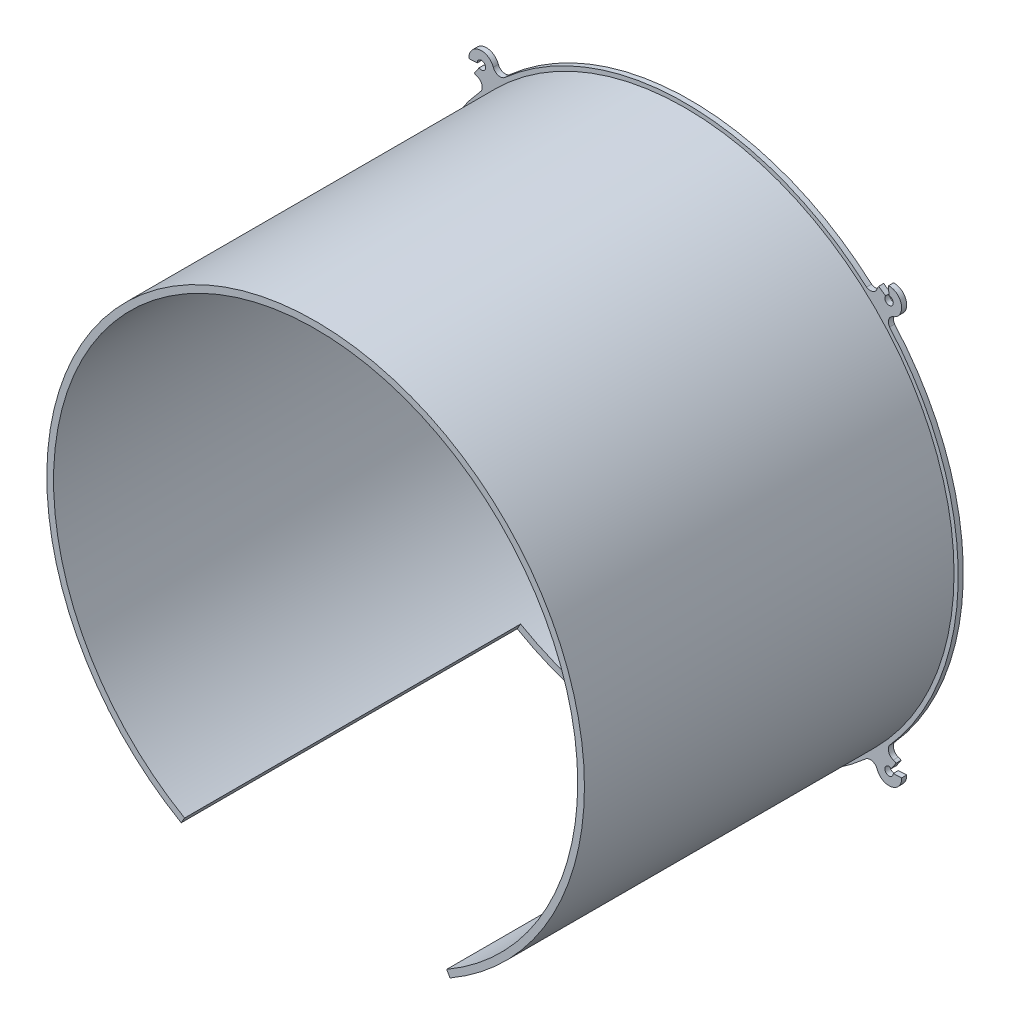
ISO-10303-21;
HEADER;
FILE_DESCRIPTION(('STEP AP214'),'2;1');
FILE_NAME('part.step','',(''),(''),'','','');
FILE_SCHEMA(('AUTOMOTIVE_DESIGN { 1 0 10303 214 1 1 1 1 }'));
ENDSEC;
DATA;
#1=APPLICATION_CONTEXT('core data for automotive mechanical design processes');
#2=APPLICATION_PROTOCOL_DEFINITION('international standard','automotive_design',2000,#1);
#3=PRODUCT_CONTEXT('',#1,'mechanical');
#4=PRODUCT('Part','Part','',(#3));
#5=PRODUCT_RELATED_PRODUCT_CATEGORY('part','',(#4));
#6=PRODUCT_DEFINITION_FORMATION('','',#4);
#7=PRODUCT_DEFINITION_CONTEXT('part definition',#1,'design');
#8=PRODUCT_DEFINITION('design','',#6,#7);
#9=PRODUCT_DEFINITION_SHAPE('','',#8);
#10=(LENGTH_UNIT() NAMED_UNIT(*) SI_UNIT(.MILLI.,.METRE.));
#11=(NAMED_UNIT(*) PLANE_ANGLE_UNIT() SI_UNIT($,.RADIAN.));
#12=(NAMED_UNIT(*) SI_UNIT($,.STERADIAN.) SOLID_ANGLE_UNIT());
#13=UNCERTAINTY_MEASURE_WITH_UNIT(LENGTH_MEASURE(1.E-05),#10,'distance_accuracy_value','');
#14=(GEOMETRIC_REPRESENTATION_CONTEXT(3) GLOBAL_UNCERTAINTY_ASSIGNED_CONTEXT((#13)) GLOBAL_UNIT_ASSIGNED_CONTEXT((#10,
#11,#12)) REPRESENTATION_CONTEXT('',''));
#15=CARTESIAN_POINT('',(0.,0.,0.));
#16=DIRECTION('',(0.,0.,1.));
#17=DIRECTION('',(1.,0.,0.));
#18=AXIS2_PLACEMENT_3D('',#15,#16,#17);
#19=CARTESIAN_POINT('',(121.316615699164,121.316615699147,3.));
#20=DIRECTION('',(0.,0.,1.));
#21=DIRECTION('',(1.,0.,0.));
#22=AXIS2_PLACEMENT_3D('',#19,#20,#21);
#23=PLANE('',#22);
#24=CARTESIAN_POINT('',(0.,0.,3.));
#25=DIRECTION('',(0.,0.,1.));
#26=DIRECTION('',(1.,0.,0.));
#27=AXIS2_PLACEMENT_3D('',#24,#25,#26);
#28=CIRCLE('',#27,160.);
#29=CARTESIAN_POINT('',(160.,0.,3.));
#30=VERTEX_POINT('',#29);
#31=EDGE_CURVE('E435',#30,#30,#28,.T.);
#32=ORIENTED_EDGE('',*,*,#31,.F.);
#33=EDGE_LOOP('',(#32));
#34=FACE_BOUND('',#33,.T.);
#35=CARTESIAN_POINT('',(121.316615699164,121.316615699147,3.));
#36=DIRECTION('',(0.,0.,1.));
#37=DIRECTION('',(1.,0.,0.));
#38=AXIS2_PLACEMENT_3D('',#35,#36,#37);
#39=CIRCLE('',#38,7.50000000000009);
#40=CARTESIAN_POINT('',(123.815697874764,114.245223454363,3.));
#41=VERTEX_POINT('',#40);
#42=CARTESIAN_POINT('',(121.00503651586,128.81014079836,3.));
#43=VERTEX_POINT('',#42);
#44=EDGE_CURVE('E349',#41,#43,#39,.T.);
#45=ORIENTED_EDGE('',*,*,#44,.T.);
#46=DIRECTION('',(0.0415438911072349,-0.999136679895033,0.));
#47=VECTOR('',#46,1.);
#48=CARTESIAN_POINT('',(121.212755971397,123.814457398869,3.));
#49=LINE('',#48,#47);
#50=CARTESIAN_POINT('',(121.212755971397,123.814457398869,3.));
#51=VERTEX_POINT('',#50);
#52=EDGE_CURVE('E171',#43,#51,#49,.T.);
#53=ORIENTED_EDGE('',*,*,#52,.T.);
#54=CARTESIAN_POINT('',(121.316615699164,121.316615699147,3.));
#55=DIRECTION('',(0.,0.,-1.));
#56=DIRECTION('',(1.,0.,0.));
#57=AXIS2_PLACEMENT_3D('',#54,#55,#56);
#58=CIRCLE('',#57,2.49999999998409);
#59=CARTESIAN_POINT('',(119.245818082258,122.717257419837,3.));
#60=VERTEX_POINT('',#59);
#61=EDGE_CURVE('E448',#51,#60,#58,.T.);
#62=ORIENTED_EDGE('',*,*,#61,.T.);
#63=DIRECTION('',(-0.828319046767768,0.560256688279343,0.));
#64=VECTOR('',#63,1.);
#65=CARTESIAN_POINT('',(119.245818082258,122.717257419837,3.));
#66=LINE('',#65,#64);
#67=CARTESIAN_POINT('',(115.104222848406,125.518540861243,3.));
#68=VERTEX_POINT('',#67);
#69=EDGE_CURVE('E450',#60,#68,#66,.T.);
#70=ORIENTED_EDGE('',*,*,#69,.T.);
#71=CARTESIAN_POINT('',(121.316615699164,121.316615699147,3.));
#72=DIRECTION('',(0.,0.,1.));
#73=DIRECTION('',(1.,0.,0.));
#74=AXIS2_PLACEMENT_3D('',#71,#72,#73);
#75=CIRCLE('',#74,7.50000000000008);
#76=CARTESIAN_POINT('',(114.245223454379,123.815697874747,3.));
#77=VERTEX_POINT('',#76);
#78=EDGE_CURVE('E452',#68,#77,#75,.T.);
#79=ORIENTED_EDGE('',*,*,#78,.T.);
#80=CARTESIAN_POINT('',(110.151172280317,125.189414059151,3.));
#81=DIRECTION('',(0.,0.,-1.));
#82=DIRECTION('',(1.,0.,0.));
#83=AXIS2_PLACEMENT_3D('',#80,#81,#82);
#84=CIRCLE('',#83,4.31837367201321);
#85=CARTESIAN_POINT('',(107.90829443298,121.499176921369,3.));
#86=VERTEX_POINT('',#85);
#87=EDGE_CURVE('E454',#77,#86,#84,.T.);
#88=ORIENTED_EDGE('',*,*,#87,.T.);
#89=CARTESIAN_POINT('',(1.6625054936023E-12,-1.5112739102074E-12,3.));
#90=DIRECTION('',(0.,0.,1.));
#91=DIRECTION('',(1.,0.,0.));
#92=AXIS2_PLACEMENT_3D('',#89,#90,#91);
#93=CIRCLE('',#92,162.500000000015);
#94=CARTESIAN_POINT('',(-107.756168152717,121.634116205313,3.));
#95=VERTEX_POINT('',#94);
#96=EDGE_CURVE('E456',#86,#95,#93,.T.);
#97=ORIENTED_EDGE('',*,*,#96,.T.);
#98=CARTESIAN_POINT('',(-110.147061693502,125.264018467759,3.));
#99=DIRECTION('',(0.,0.,-1.));
#100=DIRECTION('',(1.,0.,0.));
#101=AXIS2_PLACEMENT_3D('',#98,#99,#100);
#102=CIRCLE('',#101,4.34655752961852);
#103=CARTESIAN_POINT('',(-114.245223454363,123.815697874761,3.));
#104=VERTEX_POINT('',#103);
#105=EDGE_CURVE('E458',#95,#104,#102,.T.);
#106=ORIENTED_EDGE('',*,*,#105,.T.);
#107=CARTESIAN_POINT('',(-121.316615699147,121.316615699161,3.));
#108=DIRECTION('',(0.,0.,1.));
#109=DIRECTION('',(1.,0.,0.));
#110=AXIS2_PLACEMENT_3D('',#107,#108,#109);
#111=CIRCLE('',#110,7.5000000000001);
#112=CARTESIAN_POINT('',(-128.81014079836,121.005036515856,3.));
#113=VERTEX_POINT('',#112);
#114=EDGE_CURVE('E460',#104,#113,#111,.T.);
#115=ORIENTED_EDGE('',*,*,#114,.T.);
#116=DIRECTION('',(0.999136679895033,0.0415438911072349,0.));
#117=VECTOR('',#116,1.);
#118=CARTESIAN_POINT('',(-123.814457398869,121.212755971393,3.));
#119=LINE('',#118,#117);
#120=CARTESIAN_POINT('',(-123.814457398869,121.212755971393,3.));
#121=VERTEX_POINT('',#120);
#122=EDGE_CURVE('E462',#113,#121,#119,.T.);
#123=ORIENTED_EDGE('',*,*,#122,.T.);
#124=CARTESIAN_POINT('',(-121.316615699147,121.316615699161,3.));
#125=DIRECTION('',(0.,0.,-1.));
#126=DIRECTION('',(1.,0.,0.));
#127=AXIS2_PLACEMENT_3D('',#124,#125,#126);
#128=CIRCLE('',#127,2.49999999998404);
#129=CARTESIAN_POINT('',(-122.717257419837,119.245818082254,3.));
#130=VERTEX_POINT('',#129);
#131=EDGE_CURVE('E464',#121,#130,#128,.T.);
#132=ORIENTED_EDGE('',*,*,#131,.T.);
#133=DIRECTION('',(-0.560256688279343,-0.828319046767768,0.));
#134=VECTOR('',#133,1.);
#135=CARTESIAN_POINT('',(-122.717257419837,119.245818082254,3.));
#136=LINE('',#135,#134);
#137=CARTESIAN_POINT('',(-125.518540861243,115.104222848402,3.));
#138=VERTEX_POINT('',#137);
#139=EDGE_CURVE('E466',#130,#138,#136,.T.);
#140=ORIENTED_EDGE('',*,*,#139,.T.);
#141=CARTESIAN_POINT('',(-121.316615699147,121.316615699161,3.));
#142=DIRECTION('',(0.,0.,1.));
#143=DIRECTION('',(1.,0.,0.));
#144=AXIS2_PLACEMENT_3D('',#141,#142,#143);
#145=CIRCLE('',#144,7.50000000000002);
#146=CARTESIAN_POINT('',(-123.815697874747,114.245223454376,3.));
#147=VERTEX_POINT('',#146);
#148=EDGE_CURVE('E468',#138,#147,#145,.T.);
#149=ORIENTED_EDGE('',*,*,#148,.T.);
#150=CARTESIAN_POINT('',(-125.189414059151,110.151172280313,3.));
#151=DIRECTION('',(0.,0.,-1.));
#152=DIRECTION('',(1.,0.,0.));
#153=AXIS2_PLACEMENT_3D('',#150,#151,#152);
#154=CIRCLE('',#153,4.31837367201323);
#155=CARTESIAN_POINT('',(-121.499176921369,107.908294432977,3.));
#156=VERTEX_POINT('',#155);
#157=EDGE_CURVE('E470',#147,#156,#154,.T.);
#158=ORIENTED_EDGE('',*,*,#157,.T.);
#159=CARTESIAN_POINT('',(1.6625054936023E-12,-1.5112739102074E-12,3.));
#160=DIRECTION('',(0.,0.,1.));
#161=DIRECTION('',(1.,0.,0.));
#162=AXIS2_PLACEMENT_3D('',#159,#160,#161);
#163=CIRCLE('',#162,162.500000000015);
#164=CARTESIAN_POINT('',(-121.634116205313,-107.75616815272,3.));
#165=VERTEX_POINT('',#164);
#166=EDGE_CURVE('E472',#156,#165,#163,.T.);
#167=ORIENTED_EDGE('',*,*,#166,.T.);
#168=CARTESIAN_POINT('',(-125.264018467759,-110.147061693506,3.));
#169=DIRECTION('',(0.,0.,-1.));
#170=DIRECTION('',(1.,0.,0.));
#171=AXIS2_PLACEMENT_3D('',#168,#169,#170);
#172=CIRCLE('',#171,4.34655752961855);
#173=CARTESIAN_POINT('',(-123.815697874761,-114.245223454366,3.));
#174=VERTEX_POINT('',#173);
#175=EDGE_CURVE('E474',#165,#174,#172,.T.);
#176=ORIENTED_EDGE('',*,*,#175,.T.);
#177=CARTESIAN_POINT('',(-121.316615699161,-121.316615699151,3.));
#178=DIRECTION('',(0.,0.,1.));
#179=DIRECTION('',(1.,0.,0.));
#180=AXIS2_PLACEMENT_3D('',#177,#178,#179);
#181=CIRCLE('',#180,7.50000000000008);
#182=CARTESIAN_POINT('',(-121.005036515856,-128.810140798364,3.));
#183=VERTEX_POINT('',#182);
#184=EDGE_CURVE('E476',#174,#183,#181,.T.);
#185=ORIENTED_EDGE('',*,*,#184,.T.);
#186=DIRECTION('',(-0.0415438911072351,0.999136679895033,0.));
#187=VECTOR('',#186,1.);
#188=CARTESIAN_POINT('',(-121.212755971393,-123.814457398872,3.));
#189=LINE('',#188,#187);
#190=CARTESIAN_POINT('',(-121.212755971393,-123.814457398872,3.));
#191=VERTEX_POINT('',#190);
#192=EDGE_CURVE('E478',#183,#191,#189,.T.);
#193=ORIENTED_EDGE('',*,*,#192,.T.);
#194=CARTESIAN_POINT('',(-121.316615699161,-121.316615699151,3.));
#195=DIRECTION('',(0.,0.,-1.));
#196=DIRECTION('',(1.,0.,0.));
#197=AXIS2_PLACEMENT_3D('',#194,#195,#196);
#198=CIRCLE('',#197,2.49999999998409);
#199=CARTESIAN_POINT('',(-119.245818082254,-122.71725741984,3.));
#200=VERTEX_POINT('',#199);
#201=EDGE_CURVE('E480',#191,#200,#198,.T.);
#202=ORIENTED_EDGE('',*,*,#201,.T.);
#203=DIRECTION('',(0.828319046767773,-0.560256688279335,0.));
#204=VECTOR('',#203,1.);
#205=CARTESIAN_POINT('',(-119.245818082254,-122.71725741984,3.));
#206=LINE('',#205,#204);
#207=CARTESIAN_POINT('',(-115.104222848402,-125.518540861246,3.));
#208=VERTEX_POINT('',#207);
#209=EDGE_CURVE('E482',#200,#208,#206,.T.);
#210=ORIENTED_EDGE('',*,*,#209,.T.);
#211=CARTESIAN_POINT('',(-121.316615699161,-121.316615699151,3.));
#212=DIRECTION('',(0.,0.,1.));
#213=DIRECTION('',(1.,0.,0.));
#214=AXIS2_PLACEMENT_3D('',#211,#212,#213);
#215=CIRCLE('',#214,7.50000000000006);
#216=CARTESIAN_POINT('',(-114.245223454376,-123.815697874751,3.));
#217=VERTEX_POINT('',#216);
#218=EDGE_CURVE('E484',#208,#217,#215,.T.);
#219=ORIENTED_EDGE('',*,*,#218,.T.);
#220=CARTESIAN_POINT('',(-110.151172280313,-125.189414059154,3.));
#221=DIRECTION('',(0.,0.,-1.));
#222=DIRECTION('',(1.,0.,0.));
#223=AXIS2_PLACEMENT_3D('',#220,#221,#222);
#224=CIRCLE('',#223,4.31837367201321);
#225=CARTESIAN_POINT('',(-107.908294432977,-121.499176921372,3.));
#226=VERTEX_POINT('',#225);
#227=EDGE_CURVE('E486',#217,#226,#224,.T.);
#228=ORIENTED_EDGE('',*,*,#227,.T.);
#229=CARTESIAN_POINT('',(1.6625054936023E-12,-1.5112739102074E-12,3.));
#230=DIRECTION('',(0.,0.,1.));
#231=DIRECTION('',(1.,0.,0.));
#232=AXIS2_PLACEMENT_3D('',#229,#230,#231);
#233=CIRCLE('',#232,162.500000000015);
#234=CARTESIAN_POINT('',(107.75616815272,-121.634116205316,3.));
#235=VERTEX_POINT('',#234);
#236=EDGE_CURVE('E488',#226,#235,#233,.T.);
#237=ORIENTED_EDGE('',*,*,#236,.T.);
#238=CARTESIAN_POINT('',(110.147061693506,-125.264018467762,3.));
#239=DIRECTION('',(0.,0.,-1.));
#240=DIRECTION('',(1.,0.,0.));
#241=AXIS2_PLACEMENT_3D('',#238,#239,#240);
#242=CIRCLE('',#241,4.34655752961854);
#243=CARTESIAN_POINT('',(114.245223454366,-123.815697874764,3.));
#244=VERTEX_POINT('',#243);
#245=EDGE_CURVE('E490',#235,#244,#242,.T.);
#246=ORIENTED_EDGE('',*,*,#245,.T.);
#247=CARTESIAN_POINT('',(121.316615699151,-121.316615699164,3.));
#248=DIRECTION('',(0.,0.,1.));
#249=DIRECTION('',(1.,0.,0.));
#250=AXIS2_PLACEMENT_3D('',#247,#248,#249);
#251=CIRCLE('',#250,7.50000000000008);
#252=CARTESIAN_POINT('',(128.810140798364,-121.00503651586,3.));
#253=VERTEX_POINT('',#252);
#254=EDGE_CURVE('E492',#244,#253,#251,.T.);
#255=ORIENTED_EDGE('',*,*,#254,.T.);
#256=DIRECTION('',(-0.999136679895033,-0.0415438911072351,0.));
#257=VECTOR('',#256,1.);
#258=CARTESIAN_POINT('',(123.814457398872,-121.212755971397,3.));
#259=LINE('',#258,#257);
#260=CARTESIAN_POINT('',(123.814457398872,-121.212755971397,3.));
#261=VERTEX_POINT('',#260);
#262=EDGE_CURVE('E494',#253,#261,#259,.T.);
#263=ORIENTED_EDGE('',*,*,#262,.T.);
#264=CARTESIAN_POINT('',(121.316615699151,-121.316615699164,3.));
#265=DIRECTION('',(0.,0.,-1.));
#266=DIRECTION('',(1.,0.,0.));
#267=AXIS2_PLACEMENT_3D('',#264,#265,#266);
#268=CIRCLE('',#267,2.49999999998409);
#269=CARTESIAN_POINT('',(122.71725741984,-119.245818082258,3.));
#270=VERTEX_POINT('',#269);
#271=EDGE_CURVE('E496',#261,#270,#268,.T.);
#272=ORIENTED_EDGE('',*,*,#271,.T.);
#273=DIRECTION('',(0.560256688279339,0.82831904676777,0.));
#274=VECTOR('',#273,1.);
#275=CARTESIAN_POINT('',(122.71725741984,-119.245818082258,3.));
#276=LINE('',#275,#274);
#277=CARTESIAN_POINT('',(125.518540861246,-115.104222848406,3.));
#278=VERTEX_POINT('',#277);
#279=EDGE_CURVE('E498',#270,#278,#276,.T.);
#280=ORIENTED_EDGE('',*,*,#279,.T.);
#281=CARTESIAN_POINT('',(121.316615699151,-121.316615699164,3.));
#282=DIRECTION('',(0.,0.,1.));
#283=DIRECTION('',(1.,0.,0.));
#284=AXIS2_PLACEMENT_3D('',#281,#282,#283);
#285=CIRCLE('',#284,7.50000000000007);
#286=CARTESIAN_POINT('',(123.815697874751,-114.245223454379,3.));
#287=VERTEX_POINT('',#286);
#288=EDGE_CURVE('E264',#278,#287,#285,.T.);
#289=ORIENTED_EDGE('',*,*,#288,.T.);
#290=CARTESIAN_POINT('',(125.189414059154,-110.151172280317,3.));
#291=DIRECTION('',(0.,0.,-1.));
#292=DIRECTION('',(1.,0.,0.));
#293=AXIS2_PLACEMENT_3D('',#290,#291,#292);
#294=CIRCLE('',#293,4.31837367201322);
#295=CARTESIAN_POINT('',(121.499176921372,-107.90829443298,3.));
#296=VERTEX_POINT('',#295);
#297=EDGE_CURVE('E258',#287,#296,#294,.T.);
#298=ORIENTED_EDGE('',*,*,#297,.T.);
#299=CARTESIAN_POINT('',(1.6625054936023E-12,-1.5112739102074E-12,3.));
#300=DIRECTION('',(0.,0.,1.));
#301=DIRECTION('',(1.,0.,0.));
#302=AXIS2_PLACEMENT_3D('',#299,#300,#301);
#303=CIRCLE('',#302,162.500000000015);
#304=CARTESIAN_POINT('',(121.634116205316,107.756168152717,3.));
#305=VERTEX_POINT('',#304);
#306=EDGE_CURVE('E261',#296,#305,#303,.T.);
#307=ORIENTED_EDGE('',*,*,#306,.T.);
#308=CARTESIAN_POINT('',(125.264018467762,110.147061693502,3.));
#309=DIRECTION('',(0.,0.,-1.));
#310=DIRECTION('',(1.,0.,0.));
#311=AXIS2_PLACEMENT_3D('',#308,#309,#310);
#312=CIRCLE('',#311,4.34655752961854);
#313=EDGE_CURVE('E57',#305,#41,#312,.T.);
#314=ORIENTED_EDGE('',*,*,#313,.T.);
#315=EDGE_LOOP('',(#45,#53,#62,#70,#79,#88,#97,#106,#115,#123,#132,#140,#149,#158,#167,#176,
#185,#193,#202,#210,#219,#228,#237,#246,#255,#263,#272,#280,#289,#298,#307,#314));
#316=FACE_BOUND('',#315,.T.);
#317=ADVANCED_FACE('F33',(#34,#316),#23,.T.);
#318=CARTESIAN_POINT('',(121.316615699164,121.316615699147,0.));
#319=DIRECTION('',(0.,0.,1.));
#320=DIRECTION('',(1.,0.,0.));
#321=AXIS2_PLACEMENT_3D('',#318,#319,#320);
#322=PLANE('',#321);
#323=CARTESIAN_POINT('',(121.316615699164,121.316615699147,0.));
#324=DIRECTION('',(0.,0.,1.));
#325=DIRECTION('',(1.,0.,0.));
#326=AXIS2_PLACEMENT_3D('',#323,#324,#325);
#327=CIRCLE('',#326,7.50000000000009);
#328=CARTESIAN_POINT('',(123.815697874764,114.245223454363,0.));
#329=VERTEX_POINT('',#328);
#330=CARTESIAN_POINT('',(121.00503651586,128.81014079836,0.));
#331=VERTEX_POINT('',#330);
#332=EDGE_CURVE('E285',#329,#331,#327,.T.);
#333=ORIENTED_EDGE('',*,*,#332,.F.);
#334=CARTESIAN_POINT('',(125.264018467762,110.147061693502,0.));
#335=DIRECTION('',(0.,0.,-1.));
#336=DIRECTION('',(1.,0.,0.));
#337=AXIS2_PLACEMENT_3D('',#334,#335,#336);
#338=CIRCLE('',#337,4.34655752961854);
#339=CARTESIAN_POINT('',(121.634116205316,107.756168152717,0.));
#340=VERTEX_POINT('',#339);
#341=EDGE_CURVE('E162',#340,#329,#338,.T.);
#342=ORIENTED_EDGE('',*,*,#341,.F.);
#343=CARTESIAN_POINT('',(1.6625054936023E-12,-1.5112739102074E-12,0.));
#344=DIRECTION('',(0.,0.,1.));
#345=DIRECTION('',(1.,0.,0.));
#346=AXIS2_PLACEMENT_3D('',#343,#344,#345);
#347=CIRCLE('',#346,162.500000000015);
#348=CARTESIAN_POINT('',(121.499176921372,-107.90829443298,0.));
#349=VERTEX_POINT('',#348);
#350=EDGE_CURVE('E346',#349,#340,#347,.T.);
#351=ORIENTED_EDGE('',*,*,#350,.F.);
#352=CARTESIAN_POINT('',(125.189414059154,-110.151172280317,0.));
#353=DIRECTION('',(0.,0.,-1.));
#354=DIRECTION('',(1.,0.,0.));
#355=AXIS2_PLACEMENT_3D('',#352,#353,#354);
#356=CIRCLE('',#355,4.31837367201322);
#357=CARTESIAN_POINT('',(123.815697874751,-114.245223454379,0.));
#358=VERTEX_POINT('',#357);
#359=EDGE_CURVE('E273',#358,#349,#356,.T.);
#360=ORIENTED_EDGE('',*,*,#359,.F.);
#361=CARTESIAN_POINT('',(121.316615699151,-121.316615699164,0.));
#362=DIRECTION('',(0.,0.,1.));
#363=DIRECTION('',(1.,0.,0.));
#364=AXIS2_PLACEMENT_3D('',#361,#362,#363);
#365=CIRCLE('',#364,7.50000000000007);
#366=CARTESIAN_POINT('',(125.518540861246,-115.104222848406,0.));
#367=VERTEX_POINT('',#366);
#368=EDGE_CURVE('E343',#367,#358,#365,.T.);
#369=ORIENTED_EDGE('',*,*,#368,.F.);
#370=DIRECTION('',(0.560256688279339,0.82831904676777,0.));
#371=VECTOR('',#370,1.);
#372=CARTESIAN_POINT('',(122.71725741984,-119.245818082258,0.));
#373=LINE('',#372,#371);
#374=CARTESIAN_POINT('',(122.71725741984,-119.245818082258,0.));
#375=VERTEX_POINT('',#374);
#376=EDGE_CURVE('E341',#375,#367,#373,.T.);
#377=ORIENTED_EDGE('',*,*,#376,.F.);
#378=CARTESIAN_POINT('',(121.316615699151,-121.316615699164,0.));
#379=DIRECTION('',(0.,0.,-1.));
#380=DIRECTION('',(1.,0.,0.));
#381=AXIS2_PLACEMENT_3D('',#378,#379,#380);
#382=CIRCLE('',#381,2.49999999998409);
#383=CARTESIAN_POINT('',(123.814457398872,-121.212755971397,0.));
#384=VERTEX_POINT('',#383);
#385=EDGE_CURVE('E339',#384,#375,#382,.T.);
#386=ORIENTED_EDGE('',*,*,#385,.F.);
#387=DIRECTION('',(-0.999136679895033,-0.0415438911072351,0.));
#388=VECTOR('',#387,1.);
#389=CARTESIAN_POINT('',(123.814457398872,-121.212755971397,0.));
#390=LINE('',#389,#388);
#391=CARTESIAN_POINT('',(128.810140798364,-121.00503651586,0.));
#392=VERTEX_POINT('',#391);
#393=EDGE_CURVE('E337',#392,#384,#390,.T.);
#394=ORIENTED_EDGE('',*,*,#393,.F.);
#395=CARTESIAN_POINT('',(121.316615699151,-121.316615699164,0.));
#396=DIRECTION('',(0.,0.,1.));
#397=DIRECTION('',(1.,0.,0.));
#398=AXIS2_PLACEMENT_3D('',#395,#396,#397);
#399=CIRCLE('',#398,7.50000000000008);
#400=CARTESIAN_POINT('',(114.245223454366,-123.815697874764,0.));
#401=VERTEX_POINT('',#400);
#402=EDGE_CURVE('E335',#401,#392,#399,.T.);
#403=ORIENTED_EDGE('',*,*,#402,.F.);
#404=CARTESIAN_POINT('',(110.147061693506,-125.264018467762,0.));
#405=DIRECTION('',(0.,0.,-1.));
#406=DIRECTION('',(1.,0.,0.));
#407=AXIS2_PLACEMENT_3D('',#404,#405,#406);
#408=CIRCLE('',#407,4.34655752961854);
#409=CARTESIAN_POINT('',(107.75616815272,-121.634116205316,0.));
#410=VERTEX_POINT('',#409);
#411=EDGE_CURVE('E333',#410,#401,#408,.T.);
#412=ORIENTED_EDGE('',*,*,#411,.F.);
#413=CARTESIAN_POINT('',(1.6625054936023E-12,-1.5112739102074E-12,0.));
#414=DIRECTION('',(0.,0.,1.));
#415=DIRECTION('',(1.,0.,0.));
#416=AXIS2_PLACEMENT_3D('',#413,#414,#415);
#417=CIRCLE('',#416,162.500000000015);
#418=CARTESIAN_POINT('',(-107.908294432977,-121.499176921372,0.));
#419=VERTEX_POINT('',#418);
#420=EDGE_CURVE('E331',#419,#410,#417,.T.);
#421=ORIENTED_EDGE('',*,*,#420,.F.);
#422=CARTESIAN_POINT('',(-110.151172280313,-125.189414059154,0.));
#423=DIRECTION('',(0.,0.,-1.));
#424=DIRECTION('',(1.,0.,0.));
#425=AXIS2_PLACEMENT_3D('',#422,#423,#424);
#426=CIRCLE('',#425,4.31837367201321);
#427=CARTESIAN_POINT('',(-114.245223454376,-123.815697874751,0.));
#428=VERTEX_POINT('',#427);
#429=EDGE_CURVE('E329',#428,#419,#426,.T.);
#430=ORIENTED_EDGE('',*,*,#429,.F.);
#431=CARTESIAN_POINT('',(-121.316615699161,-121.316615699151,0.));
#432=DIRECTION('',(0.,0.,1.));
#433=DIRECTION('',(1.,0.,0.));
#434=AXIS2_PLACEMENT_3D('',#431,#432,#433);
#435=CIRCLE('',#434,7.50000000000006);
#436=CARTESIAN_POINT('',(-115.104222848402,-125.518540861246,0.));
#437=VERTEX_POINT('',#436);
#438=EDGE_CURVE('E327',#437,#428,#435,.T.);
#439=ORIENTED_EDGE('',*,*,#438,.F.);
#440=DIRECTION('',(0.828319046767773,-0.560256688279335,0.));
#441=VECTOR('',#440,1.);
#442=CARTESIAN_POINT('',(-119.245818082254,-122.71725741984,0.));
#443=LINE('',#442,#441);
#444=CARTESIAN_POINT('',(-119.245818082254,-122.71725741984,0.));
#445=VERTEX_POINT('',#444);
#446=EDGE_CURVE('E325',#445,#437,#443,.T.);
#447=ORIENTED_EDGE('',*,*,#446,.F.);
#448=CARTESIAN_POINT('',(-121.316615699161,-121.316615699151,0.));
#449=DIRECTION('',(0.,0.,-1.));
#450=DIRECTION('',(1.,0.,0.));
#451=AXIS2_PLACEMENT_3D('',#448,#449,#450);
#452=CIRCLE('',#451,2.49999999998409);
#453=CARTESIAN_POINT('',(-121.212755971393,-123.814457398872,0.));
#454=VERTEX_POINT('',#453);
#455=EDGE_CURVE('E323',#454,#445,#452,.T.);
#456=ORIENTED_EDGE('',*,*,#455,.F.);
#457=DIRECTION('',(-0.0415438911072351,0.999136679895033,0.));
#458=VECTOR('',#457,1.);
#459=CARTESIAN_POINT('',(-121.212755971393,-123.814457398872,0.));
#460=LINE('',#459,#458);
#461=CARTESIAN_POINT('',(-121.005036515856,-128.810140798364,0.));
#462=VERTEX_POINT('',#461);
#463=EDGE_CURVE('E321',#462,#454,#460,.T.);
#464=ORIENTED_EDGE('',*,*,#463,.F.);
#465=CARTESIAN_POINT('',(-121.316615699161,-121.316615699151,0.));
#466=DIRECTION('',(0.,0.,1.));
#467=DIRECTION('',(1.,0.,0.));
#468=AXIS2_PLACEMENT_3D('',#465,#466,#467);
#469=CIRCLE('',#468,7.50000000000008);
#470=CARTESIAN_POINT('',(-123.815697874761,-114.245223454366,0.));
#471=VERTEX_POINT('',#470);
#472=EDGE_CURVE('E319',#471,#462,#469,.T.);
#473=ORIENTED_EDGE('',*,*,#472,.F.);
#474=CARTESIAN_POINT('',(-125.264018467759,-110.147061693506,0.));
#475=DIRECTION('',(0.,0.,-1.));
#476=DIRECTION('',(1.,0.,0.));
#477=AXIS2_PLACEMENT_3D('',#474,#475,#476);
#478=CIRCLE('',#477,4.34655752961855);
#479=CARTESIAN_POINT('',(-121.634116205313,-107.75616815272,0.));
#480=VERTEX_POINT('',#479);
#481=EDGE_CURVE('E317',#480,#471,#478,.T.);
#482=ORIENTED_EDGE('',*,*,#481,.F.);
#483=CARTESIAN_POINT('',(1.6625054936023E-12,-1.5112739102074E-12,0.));
#484=DIRECTION('',(0.,0.,1.));
#485=DIRECTION('',(1.,0.,0.));
#486=AXIS2_PLACEMENT_3D('',#483,#484,#485);
#487=CIRCLE('',#486,162.500000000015);
#488=CARTESIAN_POINT('',(-121.499176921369,107.908294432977,0.));
#489=VERTEX_POINT('',#488);
#490=EDGE_CURVE('E315',#489,#480,#487,.T.);
#491=ORIENTED_EDGE('',*,*,#490,.F.);
#492=CARTESIAN_POINT('',(-125.189414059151,110.151172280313,0.));
#493=DIRECTION('',(0.,0.,-1.));
#494=DIRECTION('',(1.,0.,0.));
#495=AXIS2_PLACEMENT_3D('',#492,#493,#494);
#496=CIRCLE('',#495,4.31837367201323);
#497=CARTESIAN_POINT('',(-123.815697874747,114.245223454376,0.));
#498=VERTEX_POINT('',#497);
#499=EDGE_CURVE('E313',#498,#489,#496,.T.);
#500=ORIENTED_EDGE('',*,*,#499,.F.);
#501=CARTESIAN_POINT('',(-121.316615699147,121.316615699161,0.));
#502=DIRECTION('',(0.,0.,1.));
#503=DIRECTION('',(1.,0.,0.));
#504=AXIS2_PLACEMENT_3D('',#501,#502,#503);
#505=CIRCLE('',#504,7.50000000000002);
#506=CARTESIAN_POINT('',(-125.518540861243,115.104222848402,0.));
#507=VERTEX_POINT('',#506);
#508=EDGE_CURVE('E311',#507,#498,#505,.T.);
#509=ORIENTED_EDGE('',*,*,#508,.F.);
#510=DIRECTION('',(-0.560256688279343,-0.828319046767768,0.));
#511=VECTOR('',#510,1.);
#512=CARTESIAN_POINT('',(-122.717257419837,119.245818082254,0.));
#513=LINE('',#512,#511);
#514=CARTESIAN_POINT('',(-122.717257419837,119.245818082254,0.));
#515=VERTEX_POINT('',#514);
#516=EDGE_CURVE('E309',#515,#507,#513,.T.);
#517=ORIENTED_EDGE('',*,*,#516,.F.);
#518=CARTESIAN_POINT('',(-121.316615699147,121.316615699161,0.));
#519=DIRECTION('',(0.,0.,-1.));
#520=DIRECTION('',(1.,0.,0.));
#521=AXIS2_PLACEMENT_3D('',#518,#519,#520);
#522=CIRCLE('',#521,2.49999999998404);
#523=CARTESIAN_POINT('',(-123.814457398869,121.212755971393,0.));
#524=VERTEX_POINT('',#523);
#525=EDGE_CURVE('E307',#524,#515,#522,.T.);
#526=ORIENTED_EDGE('',*,*,#525,.F.);
#527=DIRECTION('',(0.999136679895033,0.0415438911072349,0.));
#528=VECTOR('',#527,1.);
#529=CARTESIAN_POINT('',(-123.814457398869,121.212755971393,0.));
#530=LINE('',#529,#528);
#531=CARTESIAN_POINT('',(-128.81014079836,121.005036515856,0.));
#532=VERTEX_POINT('',#531);
#533=EDGE_CURVE('E305',#532,#524,#530,.T.);
#534=ORIENTED_EDGE('',*,*,#533,.F.);
#535=CARTESIAN_POINT('',(-121.316615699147,121.316615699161,0.));
#536=DIRECTION('',(0.,0.,1.));
#537=DIRECTION('',(1.,0.,0.));
#538=AXIS2_PLACEMENT_3D('',#535,#536,#537);
#539=CIRCLE('',#538,7.5000000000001);
#540=CARTESIAN_POINT('',(-114.245223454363,123.815697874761,0.));
#541=VERTEX_POINT('',#540);
#542=EDGE_CURVE('E303',#541,#532,#539,.T.);
#543=ORIENTED_EDGE('',*,*,#542,.F.);
#544=CARTESIAN_POINT('',(-110.147061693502,125.264018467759,0.));
#545=DIRECTION('',(0.,0.,-1.));
#546=DIRECTION('',(1.,0.,0.));
#547=AXIS2_PLACEMENT_3D('',#544,#545,#546);
#548=CIRCLE('',#547,4.34655752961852);
#549=CARTESIAN_POINT('',(-107.756168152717,121.634116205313,0.));
#550=VERTEX_POINT('',#549);
#551=EDGE_CURVE('E301',#550,#541,#548,.T.);
#552=ORIENTED_EDGE('',*,*,#551,.F.);
#553=CARTESIAN_POINT('',(1.6625054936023E-12,-1.5112739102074E-12,0.));
#554=DIRECTION('',(0.,0.,1.));
#555=DIRECTION('',(1.,0.,0.));
#556=AXIS2_PLACEMENT_3D('',#553,#554,#555);
#557=CIRCLE('',#556,162.500000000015);
#558=CARTESIAN_POINT('',(107.90829443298,121.499176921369,0.));
#559=VERTEX_POINT('',#558);
#560=EDGE_CURVE('E299',#559,#550,#557,.T.);
#561=ORIENTED_EDGE('',*,*,#560,.F.);
#562=CARTESIAN_POINT('',(110.151172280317,125.189414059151,0.));
#563=DIRECTION('',(0.,0.,-1.));
#564=DIRECTION('',(1.,0.,0.));
#565=AXIS2_PLACEMENT_3D('',#562,#563,#564);
#566=CIRCLE('',#565,4.31837367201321);
#567=CARTESIAN_POINT('',(114.245223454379,123.815697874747,0.));
#568=VERTEX_POINT('',#567);
#569=EDGE_CURVE('E297',#568,#559,#566,.T.);
#570=ORIENTED_EDGE('',*,*,#569,.F.);
#571=CARTESIAN_POINT('',(121.316615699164,121.316615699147,0.));
#572=DIRECTION('',(0.,0.,1.));
#573=DIRECTION('',(1.,0.,0.));
#574=AXIS2_PLACEMENT_3D('',#571,#572,#573);
#575=CIRCLE('',#574,7.50000000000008);
#576=CARTESIAN_POINT('',(115.104222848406,125.518540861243,0.));
#577=VERTEX_POINT('',#576);
#578=EDGE_CURVE('E295',#577,#568,#575,.T.);
#579=ORIENTED_EDGE('',*,*,#578,.F.);
#580=DIRECTION('',(-0.828319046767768,0.560256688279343,0.));
#581=VECTOR('',#580,1.);
#582=CARTESIAN_POINT('',(119.245818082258,122.717257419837,0.));
#583=LINE('',#582,#581);
#584=CARTESIAN_POINT('',(119.245818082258,122.717257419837,0.));
#585=VERTEX_POINT('',#584);
#586=EDGE_CURVE('E293',#585,#577,#583,.T.);
#587=ORIENTED_EDGE('',*,*,#586,.F.);
#588=CARTESIAN_POINT('',(121.316615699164,121.316615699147,0.));
#589=DIRECTION('',(0.,0.,-1.));
#590=DIRECTION('',(1.,0.,0.));
#591=AXIS2_PLACEMENT_3D('',#588,#589,#590);
#592=CIRCLE('',#591,2.49999999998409);
#593=CARTESIAN_POINT('',(121.212755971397,123.814457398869,0.));
#594=VERTEX_POINT('',#593);
#595=EDGE_CURVE('E291',#594,#585,#592,.T.);
#596=ORIENTED_EDGE('',*,*,#595,.F.);
#597=DIRECTION('',(0.0415438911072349,-0.999136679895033,0.));
#598=VECTOR('',#597,1.);
#599=CARTESIAN_POINT('',(121.212755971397,123.814457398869,0.));
#600=LINE('',#599,#598);
#601=EDGE_CURVE('E288',#331,#594,#600,.T.);
#602=ORIENTED_EDGE('',*,*,#601,.F.);
#603=EDGE_LOOP('',(#333,#342,#351,#360,#369,#377,#386,#394,#403,#412,#421,#430,#439,#447,#456,
#464,#473,#482,#491,#500,#509,#517,#526,#534,#543,#552,#561,#570,#579,#587,#596,#602));
#604=FACE_BOUND('',#603,.T.);
#605=CARTESIAN_POINT('',(0.,0.,0.));
#606=DIRECTION('',(0.,0.,1.));
#607=DIRECTION('',(1.,0.,0.));
#608=AXIS2_PLACEMENT_3D('',#605,#606,#607);
#609=CIRCLE('',#608,156.);
#610=CARTESIAN_POINT('',(156.,0.,0.));
#611=VERTEX_POINT('',#610);
#612=EDGE_CURVE('E289',#611,#611,#609,.T.);
#613=ORIENTED_EDGE('',*,*,#612,.T.);
#614=EDGE_LOOP('',(#613));
#615=FACE_BOUND('',#614,.T.);
#616=ADVANCED_FACE('F511',(#604,#615),#322,.F.);
#617=CARTESIAN_POINT('',(121.316615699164,121.316615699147,3.));
#618=DIRECTION('',(0.,0.,-1.));
#619=DIRECTION('',(-1.,0.,0.));
#620=AXIS2_PLACEMENT_3D('',#617,#618,#619);
#621=CYLINDRICAL_SURFACE('',#620,7.50000000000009);
#622=ORIENTED_EDGE('',*,*,#332,.T.);
#623=DIRECTION('',(0.,0.,-1.));
#624=VECTOR('',#623,1.);
#625=CARTESIAN_POINT('',(121.00503651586,128.81014079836,3.));
#626=LINE('',#625,#624);
#627=EDGE_CURVE('E434',#43,#331,#626,.T.);
#628=ORIENTED_EDGE('',*,*,#627,.F.);
#629=ORIENTED_EDGE('',*,*,#44,.F.);
#630=DIRECTION('',(0.,0.,-1.));
#631=VECTOR('',#630,1.);
#632=CARTESIAN_POINT('',(123.815697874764,114.245223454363,3.));
#633=LINE('',#632,#631);
#634=EDGE_CURVE('E281',#41,#329,#633,.T.);
#635=ORIENTED_EDGE('',*,*,#634,.T.);
#636=EDGE_LOOP('',(#622,#628,#629,#635));
#637=FACE_BOUND('',#636,.T.);
#638=ADVANCED_FACE('F35',(#637),#621,.T.);
#639=CARTESIAN_POINT('',(121.212755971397,123.814457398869,3.));
#640=DIRECTION('',(0.999136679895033,0.0415438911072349,0.));
#641=DIRECTION('',(-0.0415438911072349,0.999136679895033,0.));
#642=AXIS2_PLACEMENT_3D('',#639,#640,#641);
#643=PLANE('',#642);
#644=ORIENTED_EDGE('',*,*,#601,.T.);
#645=DIRECTION('',(0.,0.,-1.));
#646=VECTOR('',#645,1.);
#647=CARTESIAN_POINT('',(121.212755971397,123.814457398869,3.));
#648=LINE('',#647,#646);
#649=EDGE_CURVE('E431',#51,#594,#648,.T.);
#650=ORIENTED_EDGE('',*,*,#649,.F.);
#651=ORIENTED_EDGE('',*,*,#52,.F.);
#652=ORIENTED_EDGE('',*,*,#627,.T.);
#653=EDGE_LOOP('',(#644,#650,#651,#652));
#654=FACE_BOUND('',#653,.T.);
#655=ADVANCED_FACE('F519',(#654),#643,.F.);
#656=CARTESIAN_POINT('',(121.316615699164,121.316615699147,3.));
#657=DIRECTION('',(0.,0.,-1.));
#658=DIRECTION('',(-1.,0.,0.));
#659=AXIS2_PLACEMENT_3D('',#656,#657,#658);
#660=CYLINDRICAL_SURFACE('',#659,2.49999999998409);
#661=ORIENTED_EDGE('',*,*,#595,.T.);
#662=DIRECTION('',(0.,0.,-1.));
#663=VECTOR('',#662,1.);
#664=CARTESIAN_POINT('',(119.245818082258,122.717257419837,3.));
#665=LINE('',#664,#663);
#666=EDGE_CURVE('E428',#60,#585,#665,.T.);
#667=ORIENTED_EDGE('',*,*,#666,.F.);
#668=ORIENTED_EDGE('',*,*,#61,.F.);
#669=ORIENTED_EDGE('',*,*,#649,.T.);
#670=EDGE_LOOP('',(#661,#667,#668,#669));
#671=FACE_BOUND('',#670,.T.);
#672=ADVANCED_FACE('F522',(#671),#660,.F.);
#673=CARTESIAN_POINT('',(119.245818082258,122.717257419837,3.));
#674=DIRECTION('',(-0.560256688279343,-0.828319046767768,0.));
#675=DIRECTION('',(0.828319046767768,-0.560256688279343,0.));
#676=AXIS2_PLACEMENT_3D('',#673,#674,#675);
#677=PLANE('',#676);
#678=ORIENTED_EDGE('',*,*,#586,.T.);
#679=DIRECTION('',(0.,0.,-1.));
#680=VECTOR('',#679,1.);
#681=CARTESIAN_POINT('',(115.104222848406,125.518540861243,3.));
#682=LINE('',#681,#680);
#683=EDGE_CURVE('E425',#68,#577,#682,.T.);
#684=ORIENTED_EDGE('',*,*,#683,.F.);
#685=ORIENTED_EDGE('',*,*,#69,.F.);
#686=ORIENTED_EDGE('',*,*,#666,.T.);
#687=EDGE_LOOP('',(#678,#684,#685,#686));
#688=FACE_BOUND('',#687,.T.);
#689=ADVANCED_FACE('F527',(#688),#677,.F.);
#690=CARTESIAN_POINT('',(121.316615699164,121.316615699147,3.));
#691=DIRECTION('',(0.,0.,-1.));
#692=DIRECTION('',(-1.,0.,0.));
#693=AXIS2_PLACEMENT_3D('',#690,#691,#692);
#694=CYLINDRICAL_SURFACE('',#693,7.50000000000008);
#695=ORIENTED_EDGE('',*,*,#578,.T.);
#696=DIRECTION('',(0.,0.,-1.));
#697=VECTOR('',#696,1.);
#698=CARTESIAN_POINT('',(114.245223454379,123.815697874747,3.));
#699=LINE('',#698,#697);
#700=EDGE_CURVE('E422',#77,#568,#699,.T.);
#701=ORIENTED_EDGE('',*,*,#700,.F.);
#702=ORIENTED_EDGE('',*,*,#78,.F.);
#703=ORIENTED_EDGE('',*,*,#683,.T.);
#704=EDGE_LOOP('',(#695,#701,#702,#703));
#705=FACE_BOUND('',#704,.T.);
#706=ADVANCED_FACE('F533',(#705),#694,.T.);
#707=CARTESIAN_POINT('',(110.151172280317,125.189414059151,3.));
#708=DIRECTION('',(0.,0.,-1.));
#709=DIRECTION('',(-1.,0.,0.));
#710=AXIS2_PLACEMENT_3D('',#707,#708,#709);
#711=CYLINDRICAL_SURFACE('',#710,4.31837367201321);
#712=ORIENTED_EDGE('',*,*,#569,.T.);
#713=DIRECTION('',(0.,0.,-1.));
#714=VECTOR('',#713,1.);
#715=CARTESIAN_POINT('',(107.90829443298,121.499176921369,3.));
#716=LINE('',#715,#714);
#717=EDGE_CURVE('E419',#86,#559,#716,.T.);
#718=ORIENTED_EDGE('',*,*,#717,.F.);
#719=ORIENTED_EDGE('',*,*,#87,.F.);
#720=ORIENTED_EDGE('',*,*,#700,.T.);
#721=EDGE_LOOP('',(#712,#718,#719,#720));
#722=FACE_BOUND('',#721,.T.);
#723=ADVANCED_FACE('F537',(#722),#711,.F.);
#724=CARTESIAN_POINT('',(1.6625054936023E-12,-1.5112739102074E-12,3.));
#725=DIRECTION('',(0.,0.,-1.));
#726=DIRECTION('',(-1.,0.,0.));
#727=AXIS2_PLACEMENT_3D('',#724,#725,#726);
#728=CYLINDRICAL_SURFACE('',#727,162.500000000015);
#729=ORIENTED_EDGE('',*,*,#560,.T.);
#730=DIRECTION('',(0.,0.,-1.));
#731=VECTOR('',#730,1.);
#732=CARTESIAN_POINT('',(-107.756168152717,121.634116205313,3.));
#733=LINE('',#732,#731);
#734=EDGE_CURVE('E416',#95,#550,#733,.T.);
#735=ORIENTED_EDGE('',*,*,#734,.F.);
#736=ORIENTED_EDGE('',*,*,#96,.F.);
#737=ORIENTED_EDGE('',*,*,#717,.T.);
#738=EDGE_LOOP('',(#729,#735,#736,#737));
#739=FACE_BOUND('',#738,.T.);
#740=ADVANCED_FACE('F542',(#739),#728,.T.);
#741=CARTESIAN_POINT('',(-110.147061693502,125.264018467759,3.));
#742=DIRECTION('',(0.,0.,-1.));
#743=DIRECTION('',(-1.,0.,0.));
#744=AXIS2_PLACEMENT_3D('',#741,#742,#743);
#745=CYLINDRICAL_SURFACE('',#744,4.34655752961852);
#746=ORIENTED_EDGE('',*,*,#551,.T.);
#747=DIRECTION('',(0.,0.,-1.));
#748=VECTOR('',#747,1.);
#749=CARTESIAN_POINT('',(-114.245223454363,123.815697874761,3.));
#750=LINE('',#749,#748);
#751=EDGE_CURVE('E413',#104,#541,#750,.T.);
#752=ORIENTED_EDGE('',*,*,#751,.F.);
#753=ORIENTED_EDGE('',*,*,#105,.F.);
#754=ORIENTED_EDGE('',*,*,#734,.T.);
#755=EDGE_LOOP('',(#746,#752,#753,#754));
#756=FACE_BOUND('',#755,.T.);
#757=ADVANCED_FACE('F548',(#756),#745,.F.);
#758=CARTESIAN_POINT('',(-121.316615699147,121.316615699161,3.));
#759=DIRECTION('',(0.,0.,-1.));
#760=DIRECTION('',(-1.,0.,0.));
#761=AXIS2_PLACEMENT_3D('',#758,#759,#760);
#762=CYLINDRICAL_SURFACE('',#761,7.5000000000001);
#763=ORIENTED_EDGE('',*,*,#542,.T.);
#764=DIRECTION('',(0.,0.,-1.));
#765=VECTOR('',#764,1.);
#766=CARTESIAN_POINT('',(-128.81014079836,121.005036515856,3.));
#767=LINE('',#766,#765);
#768=EDGE_CURVE('E410',#113,#532,#767,.T.);
#769=ORIENTED_EDGE('',*,*,#768,.F.);
#770=ORIENTED_EDGE('',*,*,#114,.F.);
#771=ORIENTED_EDGE('',*,*,#751,.T.);
#772=EDGE_LOOP('',(#763,#769,#770,#771));
#773=FACE_BOUND('',#772,.T.);
#774=ADVANCED_FACE('F552',(#773),#762,.T.);
#775=CARTESIAN_POINT('',(-123.814457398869,121.212755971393,3.));
#776=DIRECTION('',(-0.0415438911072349,0.999136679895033,0.));
#777=DIRECTION('',(-0.999136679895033,-0.0415438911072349,0.));
#778=AXIS2_PLACEMENT_3D('',#775,#776,#777);
#779=PLANE('',#778);
#780=ORIENTED_EDGE('',*,*,#533,.T.);
#781=DIRECTION('',(0.,0.,-1.));
#782=VECTOR('',#781,1.);
#783=CARTESIAN_POINT('',(-123.814457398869,121.212755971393,3.));
#784=LINE('',#783,#782);
#785=EDGE_CURVE('E407',#121,#524,#784,.T.);
#786=ORIENTED_EDGE('',*,*,#785,.F.);
#787=ORIENTED_EDGE('',*,*,#122,.F.);
#788=ORIENTED_EDGE('',*,*,#768,.T.);
#789=EDGE_LOOP('',(#780,#786,#787,#788));
#790=FACE_BOUND('',#789,.T.);
#791=ADVANCED_FACE('F557',(#790),#779,.F.);
#792=CARTESIAN_POINT('',(-121.316615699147,121.316615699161,3.));
#793=DIRECTION('',(0.,0.,-1.));
#794=DIRECTION('',(-1.,0.,0.));
#795=AXIS2_PLACEMENT_3D('',#792,#793,#794);
#796=CYLINDRICAL_SURFACE('',#795,2.49999999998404);
#797=ORIENTED_EDGE('',*,*,#525,.T.);
#798=DIRECTION('',(0.,0.,-1.));
#799=VECTOR('',#798,1.);
#800=CARTESIAN_POINT('',(-122.717257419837,119.245818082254,3.));
#801=LINE('',#800,#799);
#802=EDGE_CURVE('E404',#130,#515,#801,.T.);
#803=ORIENTED_EDGE('',*,*,#802,.F.);
#804=ORIENTED_EDGE('',*,*,#131,.F.);
#805=ORIENTED_EDGE('',*,*,#785,.T.);
#806=EDGE_LOOP('',(#797,#803,#804,#805));
#807=FACE_BOUND('',#806,.T.);
#808=ADVANCED_FACE('F563',(#807),#796,.F.);
#809=CARTESIAN_POINT('',(-122.717257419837,119.245818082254,3.));
#810=DIRECTION('',(0.828319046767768,-0.560256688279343,0.));
#811=DIRECTION('',(0.560256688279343,0.828319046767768,0.));
#812=AXIS2_PLACEMENT_3D('',#809,#810,#811);
#813=PLANE('',#812);
#814=ORIENTED_EDGE('',*,*,#516,.T.);
#815=DIRECTION('',(0.,0.,-1.));
#816=VECTOR('',#815,1.);
#817=CARTESIAN_POINT('',(-125.518540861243,115.104222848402,3.));
#818=LINE('',#817,#816);
#819=EDGE_CURVE('E401',#138,#507,#818,.T.);
#820=ORIENTED_EDGE('',*,*,#819,.F.);
#821=ORIENTED_EDGE('',*,*,#139,.F.);
#822=ORIENTED_EDGE('',*,*,#802,.T.);
#823=EDGE_LOOP('',(#814,#820,#821,#822));
#824=FACE_BOUND('',#823,.T.);
#825=ADVANCED_FACE('F567',(#824),#813,.F.);
#826=CARTESIAN_POINT('',(-121.316615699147,121.316615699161,3.));
#827=DIRECTION('',(0.,0.,-1.));
#828=DIRECTION('',(-1.,0.,0.));
#829=AXIS2_PLACEMENT_3D('',#826,#827,#828);
#830=CYLINDRICAL_SURFACE('',#829,7.50000000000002);
#831=ORIENTED_EDGE('',*,*,#508,.T.);
#832=DIRECTION('',(0.,0.,-1.));
#833=VECTOR('',#832,1.);
#834=CARTESIAN_POINT('',(-123.815697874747,114.245223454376,3.));
#835=LINE('',#834,#833);
#836=EDGE_CURVE('E398',#147,#498,#835,.T.);
#837=ORIENTED_EDGE('',*,*,#836,.F.);
#838=ORIENTED_EDGE('',*,*,#148,.F.);
#839=ORIENTED_EDGE('',*,*,#819,.T.);
#840=EDGE_LOOP('',(#831,#837,#838,#839));
#841=FACE_BOUND('',#840,.T.);
#842=ADVANCED_FACE('F572',(#841),#830,.T.);
#843=CARTESIAN_POINT('',(-125.189414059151,110.151172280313,3.));
#844=DIRECTION('',(0.,0.,-1.));
#845=DIRECTION('',(-1.,0.,0.));
#846=AXIS2_PLACEMENT_3D('',#843,#844,#845);
#847=CYLINDRICAL_SURFACE('',#846,4.31837367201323);
#848=ORIENTED_EDGE('',*,*,#499,.T.);
#849=DIRECTION('',(0.,0.,-1.));
#850=VECTOR('',#849,1.);
#851=CARTESIAN_POINT('',(-121.499176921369,107.908294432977,3.));
#852=LINE('',#851,#850);
#853=EDGE_CURVE('E395',#156,#489,#852,.T.);
#854=ORIENTED_EDGE('',*,*,#853,.F.);
#855=ORIENTED_EDGE('',*,*,#157,.F.);
#856=ORIENTED_EDGE('',*,*,#836,.T.);
#857=EDGE_LOOP('',(#848,#854,#855,#856));
#858=FACE_BOUND('',#857,.T.);
#859=ADVANCED_FACE('F578',(#858),#847,.F.);
#860=CARTESIAN_POINT('',(1.6625054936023E-12,-1.5112739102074E-12,3.));
#861=DIRECTION('',(0.,0.,-1.));
#862=DIRECTION('',(-1.,0.,0.));
#863=AXIS2_PLACEMENT_3D('',#860,#861,#862);
#864=CYLINDRICAL_SURFACE('',#863,162.500000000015);
#865=ORIENTED_EDGE('',*,*,#490,.T.);
#866=DIRECTION('',(0.,0.,-1.));
#867=VECTOR('',#866,1.);
#868=CARTESIAN_POINT('',(-121.634116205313,-107.75616815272,3.));
#869=LINE('',#868,#867);
#870=EDGE_CURVE('E392',#165,#480,#869,.T.);
#871=ORIENTED_EDGE('',*,*,#870,.F.);
#872=ORIENTED_EDGE('',*,*,#166,.F.);
#873=ORIENTED_EDGE('',*,*,#853,.T.);
#874=EDGE_LOOP('',(#865,#871,#872,#873));
#875=FACE_BOUND('',#874,.T.);
#876=ADVANCED_FACE('F582',(#875),#864,.T.);
#877=CARTESIAN_POINT('',(-125.264018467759,-110.147061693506,3.));
#878=DIRECTION('',(0.,0.,-1.));
#879=DIRECTION('',(-1.,0.,0.));
#880=AXIS2_PLACEMENT_3D('',#877,#878,#879);
#881=CYLINDRICAL_SURFACE('',#880,4.34655752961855);
#882=ORIENTED_EDGE('',*,*,#481,.T.);
#883=DIRECTION('',(0.,0.,-1.));
#884=VECTOR('',#883,1.);
#885=CARTESIAN_POINT('',(-123.815697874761,-114.245223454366,3.));
#886=LINE('',#885,#884);
#887=EDGE_CURVE('E389',#174,#471,#886,.T.);
#888=ORIENTED_EDGE('',*,*,#887,.F.);
#889=ORIENTED_EDGE('',*,*,#175,.F.);
#890=ORIENTED_EDGE('',*,*,#870,.T.);
#891=EDGE_LOOP('',(#882,#888,#889,#890));
#892=FACE_BOUND('',#891,.T.);
#893=ADVANCED_FACE('F587',(#892),#881,.F.);
#894=CARTESIAN_POINT('',(-121.316615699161,-121.316615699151,3.));
#895=DIRECTION('',(0.,0.,-1.));
#896=DIRECTION('',(-1.,0.,0.));
#897=AXIS2_PLACEMENT_3D('',#894,#895,#896);
#898=CYLINDRICAL_SURFACE('',#897,7.50000000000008);
#899=ORIENTED_EDGE('',*,*,#472,.T.);
#900=DIRECTION('',(0.,0.,-1.));
#901=VECTOR('',#900,1.);
#902=CARTESIAN_POINT('',(-121.005036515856,-128.810140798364,3.));
#903=LINE('',#902,#901);
#904=EDGE_CURVE('E386',#183,#462,#903,.T.);
#905=ORIENTED_EDGE('',*,*,#904,.F.);
#906=ORIENTED_EDGE('',*,*,#184,.F.);
#907=ORIENTED_EDGE('',*,*,#887,.T.);
#908=EDGE_LOOP('',(#899,#905,#906,#907));
#909=FACE_BOUND('',#908,.T.);
#910=ADVANCED_FACE('F593',(#909),#898,.T.);
#911=CARTESIAN_POINT('',(-121.212755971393,-123.814457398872,3.));
#912=DIRECTION('',(-0.999136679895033,-0.0415438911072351,0.));
#913=DIRECTION('',(0.0415438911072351,-0.999136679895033,0.));
#914=AXIS2_PLACEMENT_3D('',#911,#912,#913);
#915=PLANE('',#914);
#916=ORIENTED_EDGE('',*,*,#463,.T.);
#917=DIRECTION('',(0.,0.,-1.));
#918=VECTOR('',#917,1.);
#919=CARTESIAN_POINT('',(-121.212755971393,-123.814457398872,3.));
#920=LINE('',#919,#918);
#921=EDGE_CURVE('E383',#191,#454,#920,.T.);
#922=ORIENTED_EDGE('',*,*,#921,.F.);
#923=ORIENTED_EDGE('',*,*,#192,.F.);
#924=ORIENTED_EDGE('',*,*,#904,.T.);
#925=EDGE_LOOP('',(#916,#922,#923,#924));
#926=FACE_BOUND('',#925,.T.);
#927=ADVANCED_FACE('F597',(#926),#915,.F.);
#928=CARTESIAN_POINT('',(-121.316615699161,-121.316615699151,3.));
#929=DIRECTION('',(0.,0.,-1.));
#930=DIRECTION('',(-1.,0.,0.));
#931=AXIS2_PLACEMENT_3D('',#928,#929,#930);
#932=CYLINDRICAL_SURFACE('',#931,2.49999999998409);
#933=ORIENTED_EDGE('',*,*,#455,.T.);
#934=DIRECTION('',(0.,0.,-1.));
#935=VECTOR('',#934,1.);
#936=CARTESIAN_POINT('',(-119.245818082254,-122.71725741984,3.));
#937=LINE('',#936,#935);
#938=EDGE_CURVE('E380',#200,#445,#937,.T.);
#939=ORIENTED_EDGE('',*,*,#938,.F.);
#940=ORIENTED_EDGE('',*,*,#201,.F.);
#941=ORIENTED_EDGE('',*,*,#921,.T.);
#942=EDGE_LOOP('',(#933,#939,#940,#941));
#943=FACE_BOUND('',#942,.T.);
#944=ADVANCED_FACE('F602',(#943),#932,.F.);
#945=CARTESIAN_POINT('',(-119.245818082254,-122.71725741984,3.));
#946=DIRECTION('',(0.560256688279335,0.828319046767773,0.));
#947=DIRECTION('',(-0.828319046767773,0.560256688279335,0.));
#948=AXIS2_PLACEMENT_3D('',#945,#946,#947);
#949=PLANE('',#948);
#950=ORIENTED_EDGE('',*,*,#446,.T.);
#951=DIRECTION('',(0.,0.,-1.));
#952=VECTOR('',#951,1.);
#953=CARTESIAN_POINT('',(-115.104222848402,-125.518540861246,3.));
#954=LINE('',#953,#952);
#955=EDGE_CURVE('E377',#208,#437,#954,.T.);
#956=ORIENTED_EDGE('',*,*,#955,.F.);
#957=ORIENTED_EDGE('',*,*,#209,.F.);
#958=ORIENTED_EDGE('',*,*,#938,.T.);
#959=EDGE_LOOP('',(#950,#956,#957,#958));
#960=FACE_BOUND('',#959,.T.);
#961=ADVANCED_FACE('F608',(#960),#949,.F.);
#962=CARTESIAN_POINT('',(-121.316615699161,-121.316615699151,3.));
#963=DIRECTION('',(0.,0.,-1.));
#964=DIRECTION('',(-1.,0.,0.));
#965=AXIS2_PLACEMENT_3D('',#962,#963,#964);
#966=CYLINDRICAL_SURFACE('',#965,7.50000000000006);
#967=ORIENTED_EDGE('',*,*,#438,.T.);
#968=DIRECTION('',(0.,0.,-1.));
#969=VECTOR('',#968,1.);
#970=CARTESIAN_POINT('',(-114.245223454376,-123.815697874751,3.));
#971=LINE('',#970,#969);
#972=EDGE_CURVE('E374',#217,#428,#971,.T.);
#973=ORIENTED_EDGE('',*,*,#972,.F.);
#974=ORIENTED_EDGE('',*,*,#218,.F.);
#975=ORIENTED_EDGE('',*,*,#955,.T.);
#976=EDGE_LOOP('',(#967,#973,#974,#975));
#977=FACE_BOUND('',#976,.T.);
#978=ADVANCED_FACE('F612',(#977),#966,.T.);
#979=CARTESIAN_POINT('',(-110.151172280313,-125.189414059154,3.));
#980=DIRECTION('',(0.,0.,-1.));
#981=DIRECTION('',(-1.,0.,0.));
#982=AXIS2_PLACEMENT_3D('',#979,#980,#981);
#983=CYLINDRICAL_SURFACE('',#982,4.31837367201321);
#984=ORIENTED_EDGE('',*,*,#429,.T.);
#985=DIRECTION('',(0.,0.,-1.));
#986=VECTOR('',#985,1.);
#987=CARTESIAN_POINT('',(-107.908294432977,-121.499176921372,3.));
#988=LINE('',#987,#986);
#989=EDGE_CURVE('E371',#226,#419,#988,.T.);
#990=ORIENTED_EDGE('',*,*,#989,.F.);
#991=ORIENTED_EDGE('',*,*,#227,.F.);
#992=ORIENTED_EDGE('',*,*,#972,.T.);
#993=EDGE_LOOP('',(#984,#990,#991,#992));
#994=FACE_BOUND('',#993,.T.);
#995=ADVANCED_FACE('F617',(#994),#983,.F.);
#996=CARTESIAN_POINT('',(1.6625054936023E-12,-1.5112739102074E-12,3.));
#997=DIRECTION('',(0.,0.,-1.));
#998=DIRECTION('',(-1.,0.,0.));
#999=AXIS2_PLACEMENT_3D('',#996,#997,#998);
#1000=CYLINDRICAL_SURFACE('',#999,162.500000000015);
#1001=ORIENTED_EDGE('',*,*,#420,.T.);
#1002=DIRECTION('',(0.,0.,-1.));
#1003=VECTOR('',#1002,1.);
#1004=CARTESIAN_POINT('',(107.75616815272,-121.634116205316,3.));
#1005=LINE('',#1004,#1003);
#1006=EDGE_CURVE('E368',#235,#410,#1005,.T.);
#1007=ORIENTED_EDGE('',*,*,#1006,.F.);
#1008=ORIENTED_EDGE('',*,*,#236,.F.);
#1009=ORIENTED_EDGE('',*,*,#989,.T.);
#1010=EDGE_LOOP('',(#1001,#1007,#1008,#1009));
#1011=FACE_BOUND('',#1010,.T.);
#1012=ADVANCED_FACE('F623',(#1011),#1000,.T.);
#1013=CARTESIAN_POINT('',(110.147061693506,-125.264018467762,3.));
#1014=DIRECTION('',(0.,0.,-1.));
#1015=DIRECTION('',(-1.,0.,0.));
#1016=AXIS2_PLACEMENT_3D('',#1013,#1014,#1015);
#1017=CYLINDRICAL_SURFACE('',#1016,4.34655752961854);
#1018=ORIENTED_EDGE('',*,*,#411,.T.);
#1019=DIRECTION('',(0.,0.,-1.));
#1020=VECTOR('',#1019,1.);
#1021=CARTESIAN_POINT('',(114.245223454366,-123.815697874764,3.));
#1022=LINE('',#1021,#1020);
#1023=EDGE_CURVE('E365',#244,#401,#1022,.T.);
#1024=ORIENTED_EDGE('',*,*,#1023,.F.);
#1025=ORIENTED_EDGE('',*,*,#245,.F.);
#1026=ORIENTED_EDGE('',*,*,#1006,.T.);
#1027=EDGE_LOOP('',(#1018,#1024,#1025,#1026));
#1028=FACE_BOUND('',#1027,.T.);
#1029=ADVANCED_FACE('F627',(#1028),#1017,.F.);
#1030=CARTESIAN_POINT('',(121.316615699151,-121.316615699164,3.));
#1031=DIRECTION('',(0.,0.,-1.));
#1032=DIRECTION('',(-1.,0.,0.));
#1033=AXIS2_PLACEMENT_3D('',#1030,#1031,#1032);
#1034=CYLINDRICAL_SURFACE('',#1033,7.50000000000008);
#1035=ORIENTED_EDGE('',*,*,#402,.T.);
#1036=DIRECTION('',(0.,0.,-1.));
#1037=VECTOR('',#1036,1.);
#1038=CARTESIAN_POINT('',(128.810140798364,-121.00503651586,3.));
#1039=LINE('',#1038,#1037);
#1040=EDGE_CURVE('E362',#253,#392,#1039,.T.);
#1041=ORIENTED_EDGE('',*,*,#1040,.F.);
#1042=ORIENTED_EDGE('',*,*,#254,.F.);
#1043=ORIENTED_EDGE('',*,*,#1023,.T.);
#1044=EDGE_LOOP('',(#1035,#1041,#1042,#1043));
#1045=FACE_BOUND('',#1044,.T.);
#1046=ADVANCED_FACE('F632',(#1045),#1034,.T.);
#1047=CARTESIAN_POINT('',(123.814457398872,-121.212755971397,3.));
#1048=DIRECTION('',(0.0415438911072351,-0.999136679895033,0.));
#1049=DIRECTION('',(0.999136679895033,0.0415438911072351,0.));
#1050=AXIS2_PLACEMENT_3D('',#1047,#1048,#1049);
#1051=PLANE('',#1050);
#1052=ORIENTED_EDGE('',*,*,#393,.T.);
#1053=DIRECTION('',(0.,0.,-1.));
#1054=VECTOR('',#1053,1.);
#1055=CARTESIAN_POINT('',(123.814457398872,-121.212755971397,3.));
#1056=LINE('',#1055,#1054);
#1057=EDGE_CURVE('E359',#261,#384,#1056,.T.);
#1058=ORIENTED_EDGE('',*,*,#1057,.F.);
#1059=ORIENTED_EDGE('',*,*,#262,.F.);
#1060=ORIENTED_EDGE('',*,*,#1040,.T.);
#1061=EDGE_LOOP('',(#1052,#1058,#1059,#1060));
#1062=FACE_BOUND('',#1061,.T.);
#1063=ADVANCED_FACE('F636',(#1062),#1051,.F.);
#1064=CARTESIAN_POINT('',(121.316615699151,-121.316615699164,3.));
#1065=DIRECTION('',(0.,0.,-1.));
#1066=DIRECTION('',(-1.,0.,0.));
#1067=AXIS2_PLACEMENT_3D('',#1064,#1065,#1066);
#1068=CYLINDRICAL_SURFACE('',#1067,2.49999999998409);
#1069=ORIENTED_EDGE('',*,*,#385,.T.);
#1070=DIRECTION('',(0.,0.,-1.));
#1071=VECTOR('',#1070,1.);
#1072=CARTESIAN_POINT('',(122.71725741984,-119.245818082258,3.));
#1073=LINE('',#1072,#1071);
#1074=EDGE_CURVE('E356',#270,#375,#1073,.T.);
#1075=ORIENTED_EDGE('',*,*,#1074,.F.);
#1076=ORIENTED_EDGE('',*,*,#271,.F.);
#1077=ORIENTED_EDGE('',*,*,#1057,.T.);
#1078=EDGE_LOOP('',(#1069,#1075,#1076,#1077));
#1079=FACE_BOUND('',#1078,.T.);
#1080=ADVANCED_FACE('F640',(#1079),#1068,.F.);
#1081=CARTESIAN_POINT('',(122.71725741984,-119.245818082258,3.));
#1082=DIRECTION('',(-0.82831904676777,0.560256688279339,0.));
#1083=DIRECTION('',(-0.560256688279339,-0.82831904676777,0.));
#1084=AXIS2_PLACEMENT_3D('',#1081,#1082,#1083);
#1085=PLANE('',#1084);
#1086=ORIENTED_EDGE('',*,*,#376,.T.);
#1087=DIRECTION('',(0.,0.,-1.));
#1088=VECTOR('',#1087,1.);
#1089=CARTESIAN_POINT('',(125.518540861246,-115.104222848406,3.));
#1090=LINE('',#1089,#1088);
#1091=EDGE_CURVE('E353',#278,#367,#1090,.T.);
#1092=ORIENTED_EDGE('',*,*,#1091,.F.);
#1093=ORIENTED_EDGE('',*,*,#279,.F.);
#1094=ORIENTED_EDGE('',*,*,#1074,.T.);
#1095=EDGE_LOOP('',(#1086,#1092,#1093,#1094));
#1096=FACE_BOUND('',#1095,.T.);
#1097=ADVANCED_FACE('F504',(#1096),#1085,.F.);
#1098=CARTESIAN_POINT('',(121.316615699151,-121.316615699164,3.));
#1099=DIRECTION('',(0.,0.,-1.));
#1100=DIRECTION('',(-1.,0.,0.));
#1101=AXIS2_PLACEMENT_3D('',#1098,#1099,#1100);
#1102=CYLINDRICAL_SURFACE('',#1101,7.50000000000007);
#1103=ORIENTED_EDGE('',*,*,#368,.T.);
#1104=DIRECTION('',(0.,0.,-1.));
#1105=VECTOR('',#1104,1.);
#1106=CARTESIAN_POINT('',(123.815697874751,-114.245223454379,3.));
#1107=LINE('',#1106,#1105);
#1108=EDGE_CURVE('E276',#287,#358,#1107,.T.);
#1109=ORIENTED_EDGE('',*,*,#1108,.F.);
#1110=ORIENTED_EDGE('',*,*,#288,.F.);
#1111=ORIENTED_EDGE('',*,*,#1091,.T.);
#1112=EDGE_LOOP('',(#1103,#1109,#1110,#1111));
#1113=FACE_BOUND('',#1112,.T.);
#1114=ADVANCED_FACE('F508',(#1113),#1102,.T.);
#1115=CARTESIAN_POINT('',(125.189414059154,-110.151172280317,3.));
#1116=DIRECTION('',(0.,0.,-1.));
#1117=DIRECTION('',(-1.,0.,0.));
#1118=AXIS2_PLACEMENT_3D('',#1115,#1116,#1117);
#1119=CYLINDRICAL_SURFACE('',#1118,4.31837367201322);
#1120=ORIENTED_EDGE('',*,*,#359,.T.);
#1121=DIRECTION('',(0.,0.,-1.));
#1122=VECTOR('',#1121,1.);
#1123=CARTESIAN_POINT('',(121.499176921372,-107.90829443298,3.));
#1124=LINE('',#1123,#1122);
#1125=EDGE_CURVE('E270',#296,#349,#1124,.T.);
#1126=ORIENTED_EDGE('',*,*,#1125,.F.);
#1127=ORIENTED_EDGE('',*,*,#297,.F.);
#1128=ORIENTED_EDGE('',*,*,#1108,.T.);
#1129=EDGE_LOOP('',(#1120,#1126,#1127,#1128));
#1130=FACE_BOUND('',#1129,.T.);
#1131=ADVANCED_FACE('F271',(#1130),#1119,.F.);
#1132=CARTESIAN_POINT('',(1.6625054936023E-12,-1.5112739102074E-12,3.));
#1133=DIRECTION('',(0.,0.,-1.));
#1134=DIRECTION('',(-1.,0.,0.));
#1135=AXIS2_PLACEMENT_3D('',#1132,#1133,#1134);
#1136=CYLINDRICAL_SURFACE('',#1135,162.500000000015);
#1137=ORIENTED_EDGE('',*,*,#350,.T.);
#1138=DIRECTION('',(0.,0.,-1.));
#1139=VECTOR('',#1138,1.);
#1140=CARTESIAN_POINT('',(121.634116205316,107.756168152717,3.));
#1141=LINE('',#1140,#1139);
#1142=EDGE_CURVE('E277',#305,#340,#1141,.T.);
#1143=ORIENTED_EDGE('',*,*,#1142,.F.);
#1144=ORIENTED_EDGE('',*,*,#306,.F.);
#1145=ORIENTED_EDGE('',*,*,#1125,.T.);
#1146=EDGE_LOOP('',(#1137,#1143,#1144,#1145));
#1147=FACE_BOUND('',#1146,.T.);
#1148=ADVANCED_FACE('F279',(#1147),#1136,.T.);
#1149=CARTESIAN_POINT('',(125.264018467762,110.147061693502,3.));
#1150=DIRECTION('',(0.,0.,-1.));
#1151=DIRECTION('',(-1.,0.,0.));
#1152=AXIS2_PLACEMENT_3D('',#1149,#1150,#1151);
#1153=CYLINDRICAL_SURFACE('',#1152,4.34655752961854);
#1154=ORIENTED_EDGE('',*,*,#341,.T.);
#1155=ORIENTED_EDGE('',*,*,#634,.F.);
#1156=ORIENTED_EDGE('',*,*,#313,.F.);
#1157=ORIENTED_EDGE('',*,*,#1142,.T.);
#1158=EDGE_LOOP('',(#1154,#1155,#1156,#1157));
#1159=FACE_BOUND('',#1158,.T.);
#1160=ADVANCED_FACE('F513',(#1159),#1153,.F.);
#1161=CARTESIAN_POINT('',(0.,0.,0.));
#1162=DIRECTION('',(0.,0.,1.));
#1163=DIRECTION('',(1.,0.,0.));
#1164=AXIS2_PLACEMENT_3D('',#1161,#1162,#1163);
#1165=CYLINDRICAL_SURFACE('',#1164,160.);
#1166=DIRECTION('',(0.,0.,1.));
#1167=VECTOR('',#1166,1.);
#1168=CARTESIAN_POINT('',(80.0000000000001,-138.56406460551,23.));
#1169=LINE('',#1168,#1167);
#1170=CARTESIAN_POINT('',(80.0000000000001,-138.56406460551,23.));
#1171=VERTEX_POINT('',#1170);
#1172=CARTESIAN_POINT('',(80.0000000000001,-138.56406460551,223.));
#1173=VERTEX_POINT('',#1172);
#1174=EDGE_CURVE('E753',#1171,#1173,#1169,.T.);
#1175=ORIENTED_EDGE('',*,*,#1174,.F.);
#1176=CARTESIAN_POINT('',(0.,0.,23.));
#1177=DIRECTION('',(0.,0.,1.));
#1178=DIRECTION('',(1.,0.,0.));
#1179=AXIS2_PLACEMENT_3D('',#1176,#1177,#1178);
#1180=CIRCLE('',#1179,160.);
#1181=CARTESIAN_POINT('',(-80.0000000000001,-138.56406460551,23.));
#1182=VERTEX_POINT('',#1181);
#1183=EDGE_CURVE('E766',#1182,#1171,#1180,.T.);
#1184=ORIENTED_EDGE('',*,*,#1183,.F.);
#1185=DIRECTION('',(0.,0.,1.));
#1186=VECTOR('',#1185,1.);
#1187=CARTESIAN_POINT('',(-80.0000000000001,-138.56406460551,23.));
#1188=LINE('',#1187,#1186);
#1189=CARTESIAN_POINT('',(-80.0000000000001,-138.56406460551,223.));
#1190=VERTEX_POINT('',#1189);
#1191=EDGE_CURVE('E767',#1182,#1190,#1188,.T.);
#1192=ORIENTED_EDGE('',*,*,#1191,.T.);
#1193=CARTESIAN_POINT('',(0.,0.,223.));
#1194=DIRECTION('',(0.,0.,1.));
#1195=DIRECTION('',(1.,0.,0.));
#1196=AXIS2_PLACEMENT_3D('',#1193,#1194,#1195);
#1197=CIRCLE('',#1196,160.);
#1198=EDGE_CURVE('E771',#1173,#1190,#1197,.T.);
#1199=ORIENTED_EDGE('',*,*,#1198,.F.);
#1200=EDGE_LOOP('',(#1175,#1184,#1192,#1199));
#1201=FACE_BOUND('',#1200,.T.);
#1202=ORIENTED_EDGE('',*,*,#31,.T.);
#1203=EDGE_LOOP('',(#1202));
#1204=FACE_BOUND('',#1203,.T.);
#1205=ADVANCED_FACE('F657',(#1201,#1204),#1165,.T.);
#1206=CARTESIAN_POINT('',(0.,0.,0.));
#1207=DIRECTION('',(0.,0.,1.));
#1208=DIRECTION('',(1.,0.,0.));
#1209=AXIS2_PLACEMENT_3D('',#1206,#1207,#1208);
#1210=CYLINDRICAL_SURFACE('',#1209,156.);
#1211=ORIENTED_EDGE('',*,*,#612,.F.);
#1212=EDGE_LOOP('',(#1211));
#1213=FACE_BOUND('',#1212,.T.);
#1214=CARTESIAN_POINT('',(0.,0.,23.));
#1215=DIRECTION('',(0.,0.,1.));
#1216=DIRECTION('',(1.,0.,0.));
#1217=AXIS2_PLACEMENT_3D('',#1214,#1215,#1216);
#1218=CIRCLE('',#1217,156.);
#1219=CARTESIAN_POINT('',(78.0000000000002,-135.099962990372,23.));
#1220=VERTEX_POINT('',#1219);
#1221=CARTESIAN_POINT('',(-78.0000000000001,-135.099962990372,23.));
#1222=VERTEX_POINT('',#1221);
#1223=EDGE_CURVE('E11',#1220,#1222,#1218,.F.);
#1224=ORIENTED_EDGE('',*,*,#1223,.F.);
#1225=DIRECTION('',(0.,0.,1.));
#1226=VECTOR('',#1225,1.);
#1227=CARTESIAN_POINT('',(78.0000000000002,-135.099962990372,0.));
#1228=LINE('',#1227,#1226);
#1229=CARTESIAN_POINT('',(78.0000000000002,-135.099962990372,223.));
#1230=VERTEX_POINT('',#1229);
#1231=EDGE_CURVE('E756',#1220,#1230,#1228,.T.);
#1232=ORIENTED_EDGE('',*,*,#1231,.T.);
#1233=CARTESIAN_POINT('',(0.,0.,223.));
#1234=DIRECTION('',(0.,0.,1.));
#1235=DIRECTION('',(1.,0.,0.));
#1236=AXIS2_PLACEMENT_3D('',#1233,#1234,#1235);
#1237=CIRCLE('',#1236,156.);
#1238=CARTESIAN_POINT('',(-78.0000000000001,-135.099962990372,223.));
#1239=VERTEX_POINT('',#1238);
#1240=EDGE_CURVE('E778',#1230,#1239,#1237,.T.);
#1241=ORIENTED_EDGE('',*,*,#1240,.T.);
#1242=DIRECTION('',(0.,0.,1.));
#1243=VECTOR('',#1242,1.);
#1244=CARTESIAN_POINT('',(-78.0000000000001,-135.099962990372,0.));
#1245=LINE('',#1244,#1243);
#1246=EDGE_CURVE('E48',#1239,#1222,#1245,.F.);
#1247=ORIENTED_EDGE('',*,*,#1246,.T.);
#1248=EDGE_LOOP('',(#1224,#1232,#1241,#1247));
#1249=FACE_BOUND('',#1248,.T.);
#1250=ADVANCED_FACE('F690',(#1213,#1249),#1210,.F.);
#1251=CARTESIAN_POINT('',(0.,0.,223.));
#1252=DIRECTION('',(0.,0.,1.));
#1253=DIRECTION('',(1.,0.,0.));
#1254=AXIS2_PLACEMENT_3D('',#1251,#1252,#1253);
#1255=PLANE('',#1254);
#1256=DIRECTION('',(-0.500000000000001,0.866025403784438,0.));
#1257=VECTOR('',#1256,1.);
#1258=CARTESIAN_POINT('',(0.,0.,223.));
#1259=LINE('',#1258,#1257);
#1260=EDGE_CURVE('E762',#1173,#1230,#1259,.T.);
#1261=ORIENTED_EDGE('',*,*,#1260,.F.);
#1262=ORIENTED_EDGE('',*,*,#1198,.T.);
#1263=DIRECTION('',(-0.500000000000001,-0.866025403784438,0.));
#1264=VECTOR('',#1263,1.);
#1265=CARTESIAN_POINT('',(0.,0.,223.));
#1266=LINE('',#1265,#1264);
#1267=EDGE_CURVE('E41',#1239,#1190,#1266,.T.);
#1268=ORIENTED_EDGE('',*,*,#1267,.F.);
#1269=ORIENTED_EDGE('',*,*,#1240,.F.);
#1270=EDGE_LOOP('',(#1261,#1262,#1268,#1269));
#1271=FACE_BOUND('',#1270,.T.);
#1272=ADVANCED_FACE('F701',(#1271),#1255,.T.);
#1273=CARTESIAN_POINT('',(0.,0.,23.));
#1274=DIRECTION('',(0.,0.,1.));
#1275=DIRECTION('',(1.,0.,0.));
#1276=AXIS2_PLACEMENT_3D('',#1273,#1274,#1275);
#1277=PLANE('',#1276);
#1278=ORIENTED_EDGE('',*,*,#1223,.T.);
#1279=DIRECTION('',(-0.500000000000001,-0.866025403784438,0.));
#1280=VECTOR('',#1279,1.);
#1281=CARTESIAN_POINT('',(0.,0.,23.));
#1282=LINE('',#1281,#1280);
#1283=EDGE_CURVE('E761',#1222,#1182,#1282,.T.);
#1284=ORIENTED_EDGE('',*,*,#1283,.T.);
#1285=ORIENTED_EDGE('',*,*,#1183,.T.);
#1286=DIRECTION('',(-0.500000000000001,0.866025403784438,0.));
#1287=VECTOR('',#1286,1.);
#1288=CARTESIAN_POINT('',(0.,0.,23.));
#1289=LINE('',#1288,#1287);
#1290=EDGE_CURVE('E748',#1171,#1220,#1289,.T.);
#1291=ORIENTED_EDGE('',*,*,#1290,.T.);
#1292=EDGE_LOOP('',(#1278,#1284,#1285,#1291));
#1293=FACE_BOUND('',#1292,.T.);
#1294=ADVANCED_FACE('F710',(#1293),#1277,.T.);
#1295=CARTESIAN_POINT('',(0.,0.,23.));
#1296=DIRECTION('',(0.866025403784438,0.500000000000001,0.));
#1297=DIRECTION('',(-0.500000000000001,0.866025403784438,0.));
#1298=AXIS2_PLACEMENT_3D('',#1295,#1296,#1297);
#1299=PLANE('',#1298);
#1300=ORIENTED_EDGE('',*,*,#1290,.F.);
#1301=ORIENTED_EDGE('',*,*,#1174,.T.);
#1302=ORIENTED_EDGE('',*,*,#1260,.T.);
#1303=ORIENTED_EDGE('',*,*,#1231,.F.);
#1304=EDGE_LOOP('',(#1300,#1301,#1302,#1303));
#1305=FACE_BOUND('',#1304,.T.);
#1306=ADVANCED_FACE('F720',(#1305),#1299,.F.);
#1307=CARTESIAN_POINT('',(0.,0.,23.));
#1308=DIRECTION('',(-0.866025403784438,0.500000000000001,0.));
#1309=DIRECTION('',(-0.500000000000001,-0.866025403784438,0.));
#1310=AXIS2_PLACEMENT_3D('',#1307,#1308,#1309);
#1311=PLANE('',#1310);
#1312=ORIENTED_EDGE('',*,*,#1267,.T.);
#1313=ORIENTED_EDGE('',*,*,#1191,.F.);
#1314=ORIENTED_EDGE('',*,*,#1283,.F.);
#1315=ORIENTED_EDGE('',*,*,#1246,.F.);
#1316=EDGE_LOOP('',(#1312,#1313,#1314,#1315));
#1317=FACE_BOUND('',#1316,.T.);
#1318=ADVANCED_FACE('F727',(#1317),#1311,.F.);
#1319=CLOSED_SHELL('',(#317,#616,#638,#655,#672,#689,#706,#723,#740,#757,#774,#791,#808,#825,
#842,#859,#876,#893,#910,#927,#944,#961,#978,#995,#1012,#1029,#1046,#1063,#1080,#1097,#1114,
#1131,#1148,#1160,#1205,#1250,#1272,#1294,#1306,#1318));
#1320=MANIFOLD_SOLID_BREP('B2',#1319);
#1321=ADVANCED_BREP_SHAPE_REPRESENTATION('',(#18,#1320),#14);
#1322=SHAPE_DEFINITION_REPRESENTATION(#9,#1321);
ENDSEC;
END-ISO-10303-21;
